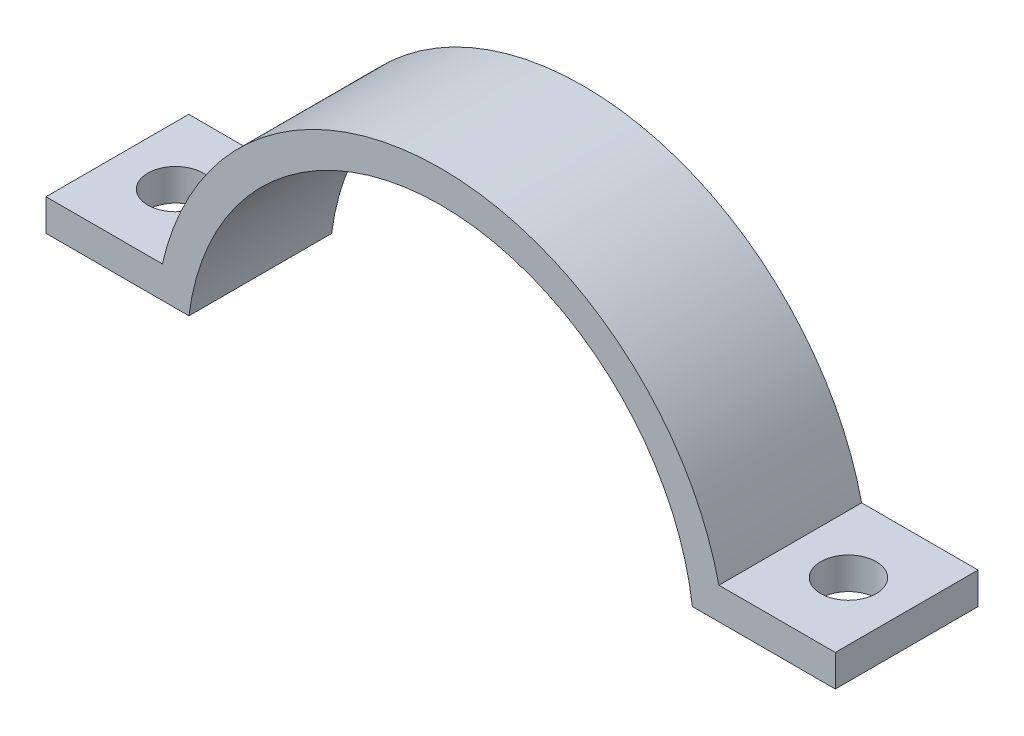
ISO-10303-21;
HEADER;
FILE_DESCRIPTION(('STEP AP214'),'2;1');
FILE_NAME('part.step','',(''),(''),'','','');
FILE_SCHEMA(('AUTOMOTIVE_DESIGN { 1 0 10303 214 1 1 1 1 }'));
ENDSEC;
DATA;
#1=APPLICATION_CONTEXT('core data for automotive mechanical design processes');
#2=APPLICATION_PROTOCOL_DEFINITION('international standard','automotive_design',2000,#1);
#3=PRODUCT_CONTEXT('',#1,'mechanical');
#4=PRODUCT('Part','Part','',(#3));
#5=PRODUCT_RELATED_PRODUCT_CATEGORY('part','',(#4));
#6=PRODUCT_DEFINITION_FORMATION('','',#4);
#7=PRODUCT_DEFINITION_CONTEXT('part definition',#1,'design');
#8=PRODUCT_DEFINITION('design','',#6,#7);
#9=PRODUCT_DEFINITION_SHAPE('','',#8);
#10=(LENGTH_UNIT() NAMED_UNIT(*) SI_UNIT(.MILLI.,.METRE.));
#11=(NAMED_UNIT(*) PLANE_ANGLE_UNIT() SI_UNIT($,.RADIAN.));
#12=(NAMED_UNIT(*) SI_UNIT($,.STERADIAN.) SOLID_ANGLE_UNIT());
#13=UNCERTAINTY_MEASURE_WITH_UNIT(LENGTH_MEASURE(1.E-05),#10,'distance_accuracy_value','');
#14=(GEOMETRIC_REPRESENTATION_CONTEXT(3) GLOBAL_UNCERTAINTY_ASSIGNED_CONTEXT((#13)) GLOBAL_UNIT_ASSIGNED_CONTEXT((#10,
#11,#12)) REPRESENTATION_CONTEXT('',''));
#15=CARTESIAN_POINT('',(0.,0.,0.));
#16=DIRECTION('',(0.,0.,1.));
#17=DIRECTION('',(1.,0.,0.));
#18=AXIS2_PLACEMENT_3D('',#15,#16,#17);
#19=CARTESIAN_POINT('',(0.,2.00000000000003,9.));
#20=DIRECTION('',(0.,1.,0.));
#21=DIRECTION('',(-1.,0.,0.));
#22=AXIS2_PLACEMENT_3D('',#19,#20,#21);
#23=PLANE('',#22);
#24=CARTESIAN_POINT('',(21.2192362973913,1.99999999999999,4.5));
#25=DIRECTION('',(0.,1.,0.));
#26=DIRECTION('',(-1.,0.,0.));
#27=AXIS2_PLACEMENT_3D('',#24,#25,#26);
#28=CIRCLE('',#27,1.75);
#29=CARTESIAN_POINT('',(19.4692362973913,1.99999999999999,4.5));
#30=VERTEX_POINT('',#29);
#31=EDGE_CURVE('E232',#30,#30,#28,.T.);
#32=ORIENTED_EDGE('',*,*,#31,.T.);
#33=EDGE_LOOP('',(#32));
#34=FACE_BOUND('',#33,.T.);
#35=DIRECTION('',(1.,0.,0.));
#36=VECTOR('',#35,1.);
#37=CARTESIAN_POINT('',(0.,2.00000000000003,0.));
#38=LINE('',#37,#36);
#39=CARTESIAN_POINT('',(15.8745078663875,2.,0.));
#40=VERTEX_POINT('',#39);
#41=CARTESIAN_POINT('',(24.8885438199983,2.,0.));
#42=VERTEX_POINT('',#41);
#43=EDGE_CURVE('E151',#40,#42,#38,.T.);
#44=ORIENTED_EDGE('',*,*,#43,.T.);
#45=DIRECTION('',(0.,0.,-1.));
#46=VECTOR('',#45,1.);
#47=CARTESIAN_POINT('',(24.8885438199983,2.,9.));
#48=LINE('',#47,#46);
#49=CARTESIAN_POINT('',(24.8885438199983,2.,9.));
#50=VERTEX_POINT('',#49);
#51=EDGE_CURVE('E11',#50,#42,#48,.T.);
#52=ORIENTED_EDGE('',*,*,#51,.F.);
#53=DIRECTION('',(1.,0.,0.));
#54=VECTOR('',#53,1.);
#55=CARTESIAN_POINT('',(0.,2.00000000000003,9.));
#56=LINE('',#55,#54);
#57=CARTESIAN_POINT('',(15.8745078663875,2.,9.));
#58=VERTEX_POINT('',#57);
#59=EDGE_CURVE('E179',#58,#50,#56,.T.);
#60=ORIENTED_EDGE('',*,*,#59,.F.);
#61=DIRECTION('',(0.,0.,-1.));
#62=VECTOR('',#61,1.);
#63=CARTESIAN_POINT('',(15.8745078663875,2.,9.));
#64=LINE('',#63,#62);
#65=EDGE_CURVE('E64',#58,#40,#64,.T.);
#66=ORIENTED_EDGE('',*,*,#65,.T.);
#67=EDGE_LOOP('',(#44,#52,#60,#66));
#68=FACE_BOUND('',#67,.T.);
#69=ADVANCED_FACE('F47',(#34,#68),#23,.F.);
#70=CARTESIAN_POINT('',(24.8885438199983,0.,9.));
#71=DIRECTION('',(-1.,0.,0.));
#72=DIRECTION('',(0.,0.,1.));
#73=AXIS2_PLACEMENT_3D('',#70,#71,#72);
#74=PLANE('',#73);
#75=DIRECTION('',(0.,1.,0.));
#76=VECTOR('',#75,1.);
#77=CARTESIAN_POINT('',(24.8885438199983,0.,0.));
#78=LINE('',#77,#76);
#79=CARTESIAN_POINT('',(24.8885438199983,3.99999999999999,0.));
#80=VERTEX_POINT('',#79);
#81=EDGE_CURVE('E154',#42,#80,#78,.T.);
#82=ORIENTED_EDGE('',*,*,#81,.T.);
#83=DIRECTION('',(0.,0.,-1.));
#84=VECTOR('',#83,1.);
#85=CARTESIAN_POINT('',(24.8885438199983,3.99999999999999,9.));
#86=LINE('',#85,#84);
#87=CARTESIAN_POINT('',(24.8885438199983,3.99999999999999,9.));
#88=VERTEX_POINT('',#87);
#89=EDGE_CURVE('E56',#88,#80,#86,.T.);
#90=ORIENTED_EDGE('',*,*,#89,.F.);
#91=DIRECTION('',(0.,1.,0.));
#92=VECTOR('',#91,1.);
#93=CARTESIAN_POINT('',(24.8885438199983,0.,9.));
#94=LINE('',#93,#92);
#95=EDGE_CURVE('E103',#50,#88,#94,.T.);
#96=ORIENTED_EDGE('',*,*,#95,.F.);
#97=ORIENTED_EDGE('',*,*,#51,.T.);
#98=EDGE_LOOP('',(#82,#90,#96,#97));
#99=FACE_BOUND('',#98,.T.);
#100=ADVANCED_FACE('F199',(#99),#74,.F.);
#101=CARTESIAN_POINT('',(0.,4.,9.));
#102=DIRECTION('',(0.,1.,0.));
#103=DIRECTION('',(-1.,0.,0.));
#104=AXIS2_PLACEMENT_3D('',#101,#102,#103);
#105=PLANE('',#104);
#106=CARTESIAN_POINT('',(21.2192362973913,4.,4.5));
#107=DIRECTION('',(0.,1.,0.));
#108=DIRECTION('',(-1.,0.,0.));
#109=AXIS2_PLACEMENT_3D('',#106,#107,#108);
#110=CIRCLE('',#109,1.75);
#111=CARTESIAN_POINT('',(19.4692362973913,4.,4.5));
#112=VERTEX_POINT('',#111);
#113=EDGE_CURVE('E243',#112,#112,#110,.T.);
#114=ORIENTED_EDGE('',*,*,#113,.F.);
#115=EDGE_LOOP('',(#114));
#116=FACE_BOUND('',#115,.T.);
#117=DIRECTION('',(1.,0.,0.));
#118=VECTOR('',#117,1.);
#119=CARTESIAN_POINT('',(0.,4.,0.));
#120=LINE('',#119,#118);
#121=CARTESIAN_POINT('',(17.5499287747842,3.99999999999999,0.));
#122=VERTEX_POINT('',#121);
#123=EDGE_CURVE('E159',#122,#80,#120,.T.);
#124=ORIENTED_EDGE('',*,*,#123,.F.);
#125=DIRECTION('',(0.,0.,-1.));
#126=VECTOR('',#125,1.);
#127=CARTESIAN_POINT('',(17.5499287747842,3.99999999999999,9.));
#128=LINE('',#127,#126);
#129=CARTESIAN_POINT('',(17.5499287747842,3.99999999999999,9.));
#130=VERTEX_POINT('',#129);
#131=EDGE_CURVE('E190',#130,#122,#128,.T.);
#132=ORIENTED_EDGE('',*,*,#131,.F.);
#133=DIRECTION('',(1.,0.,0.));
#134=VECTOR('',#133,1.);
#135=CARTESIAN_POINT('',(0.,4.,9.));
#136=LINE('',#135,#134);
#137=EDGE_CURVE('E198',#130,#88,#136,.T.);
#138=ORIENTED_EDGE('',*,*,#137,.T.);
#139=ORIENTED_EDGE('',*,*,#89,.T.);
#140=EDGE_LOOP('',(#124,#132,#138,#139));
#141=FACE_BOUND('',#140,.T.);
#142=ADVANCED_FACE('F196',(#116,#141),#105,.T.);
#143=CARTESIAN_POINT('',(0.,0.,9.));
#144=DIRECTION('',(0.,0.,-1.));
#145=DIRECTION('',(-1.,0.,0.));
#146=AXIS2_PLACEMENT_3D('',#143,#144,#145);
#147=CYLINDRICAL_SURFACE('',#146,18.);
#148=CARTESIAN_POINT('',(0.,0.,0.));
#149=DIRECTION('',(0.,0.,1.));
#150=DIRECTION('',(1.,0.,0.));
#151=AXIS2_PLACEMENT_3D('',#148,#149,#150);
#152=CIRCLE('',#151,18.);
#153=CARTESIAN_POINT('',(-17.5499287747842,4.,0.));
#154=VERTEX_POINT('',#153);
#155=EDGE_CURVE('E163',#122,#154,#152,.T.);
#156=ORIENTED_EDGE('',*,*,#155,.T.);
#157=DIRECTION('',(0.,0.,-1.));
#158=VECTOR('',#157,1.);
#159=CARTESIAN_POINT('',(-17.5499287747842,4.,9.));
#160=LINE('',#159,#158);
#161=CARTESIAN_POINT('',(-17.5499287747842,4.,9.));
#162=VERTEX_POINT('',#161);
#163=EDGE_CURVE('E186',#162,#154,#160,.T.);
#164=ORIENTED_EDGE('',*,*,#163,.F.);
#165=CARTESIAN_POINT('',(0.,0.,9.));
#166=DIRECTION('',(0.,0.,1.));
#167=DIRECTION('',(1.,0.,0.));
#168=AXIS2_PLACEMENT_3D('',#165,#166,#167);
#169=CIRCLE('',#168,18.);
#170=EDGE_CURVE('E145',#130,#162,#169,.T.);
#171=ORIENTED_EDGE('',*,*,#170,.F.);
#172=ORIENTED_EDGE('',*,*,#131,.T.);
#173=EDGE_LOOP('',(#156,#164,#171,#172));
#174=FACE_BOUND('',#173,.T.);
#175=ADVANCED_FACE('F207',(#174),#147,.T.);
#176=CARTESIAN_POINT('',(0.,4.,9.));
#177=DIRECTION('',(0.,-1.,0.));
#178=DIRECTION('',(1.,0.,0.));
#179=AXIS2_PLACEMENT_3D('',#176,#177,#178);
#180=PLANE('',#179);
#181=CARTESIAN_POINT('',(-21.2192362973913,4.,4.5));
#182=DIRECTION('',(0.,1.,0.));
#183=DIRECTION('',(-1.,0.,0.));
#184=AXIS2_PLACEMENT_3D('',#181,#182,#183);
#185=CIRCLE('',#184,1.75);
#186=CARTESIAN_POINT('',(-22.9692362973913,4.,4.5));
#187=VERTEX_POINT('',#186);
#188=EDGE_CURVE('E247',#187,#187,#185,.T.);
#189=ORIENTED_EDGE('',*,*,#188,.F.);
#190=EDGE_LOOP('',(#189));
#191=FACE_BOUND('',#190,.T.);
#192=DIRECTION('',(-1.,0.,0.));
#193=VECTOR('',#192,1.);
#194=CARTESIAN_POINT('',(0.,4.,0.));
#195=LINE('',#194,#193);
#196=CARTESIAN_POINT('',(-24.8885438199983,3.99999999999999,0.));
#197=VERTEX_POINT('',#196);
#198=EDGE_CURVE('E166',#154,#197,#195,.T.);
#199=ORIENTED_EDGE('',*,*,#198,.T.);
#200=DIRECTION('',(0.,0.,-1.));
#201=VECTOR('',#200,1.);
#202=CARTESIAN_POINT('',(-24.8885438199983,3.99999999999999,9.));
#203=LINE('',#202,#201);
#204=CARTESIAN_POINT('',(-24.8885438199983,3.99999999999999,9.));
#205=VERTEX_POINT('',#204);
#206=EDGE_CURVE('E129',#205,#197,#203,.T.);
#207=ORIENTED_EDGE('',*,*,#206,.F.);
#208=DIRECTION('',(-1.,0.,0.));
#209=VECTOR('',#208,1.);
#210=CARTESIAN_POINT('',(0.,4.,9.));
#211=LINE('',#210,#209);
#212=EDGE_CURVE('E140',#162,#205,#211,.T.);
#213=ORIENTED_EDGE('',*,*,#212,.F.);
#214=ORIENTED_EDGE('',*,*,#163,.T.);
#215=EDGE_LOOP('',(#199,#207,#213,#214));
#216=FACE_BOUND('',#215,.T.);
#217=ADVANCED_FACE('F210',(#191,#216),#180,.F.);
#218=CARTESIAN_POINT('',(-24.8885438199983,0.,9.));
#219=DIRECTION('',(-1.,0.,0.));
#220=DIRECTION('',(0.,0.,1.));
#221=AXIS2_PLACEMENT_3D('',#218,#219,#220);
#222=PLANE('',#221);
#223=DIRECTION('',(0.,1.,0.));
#224=VECTOR('',#223,1.);
#225=CARTESIAN_POINT('',(-24.8885438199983,0.,0.));
#226=LINE('',#225,#224);
#227=CARTESIAN_POINT('',(-24.8885438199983,1.99999999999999,0.));
#228=VERTEX_POINT('',#227);
#229=EDGE_CURVE('E125',#228,#197,#226,.T.);
#230=ORIENTED_EDGE('',*,*,#229,.F.);
#231=DIRECTION('',(0.,0.,-1.));
#232=VECTOR('',#231,1.);
#233=CARTESIAN_POINT('',(-24.8885438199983,1.99999999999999,9.));
#234=LINE('',#233,#232);
#235=CARTESIAN_POINT('',(-24.8885438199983,1.99999999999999,9.));
#236=VERTEX_POINT('',#235);
#237=EDGE_CURVE('E119',#236,#228,#234,.T.);
#238=ORIENTED_EDGE('',*,*,#237,.F.);
#239=DIRECTION('',(0.,1.,0.));
#240=VECTOR('',#239,1.);
#241=CARTESIAN_POINT('',(-24.8885438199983,0.,9.));
#242=LINE('',#241,#240);
#243=EDGE_CURVE('E123',#236,#205,#242,.T.);
#244=ORIENTED_EDGE('',*,*,#243,.T.);
#245=ORIENTED_EDGE('',*,*,#206,.T.);
#246=EDGE_LOOP('',(#230,#238,#244,#245));
#247=FACE_BOUND('',#246,.T.);
#248=ADVANCED_FACE('F121',(#247),#222,.T.);
#249=CARTESIAN_POINT('',(0.,2.00000000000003,9.));
#250=DIRECTION('',(0.,1.,0.));
#251=DIRECTION('',(-1.,0.,0.));
#252=AXIS2_PLACEMENT_3D('',#249,#250,#251);
#253=PLANE('',#252);
#254=CARTESIAN_POINT('',(-21.2192362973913,1.99999999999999,4.5));
#255=DIRECTION('',(0.,1.,0.));
#256=DIRECTION('',(-1.,0.,0.));
#257=AXIS2_PLACEMENT_3D('',#254,#255,#256);
#258=CIRCLE('',#257,1.75);
#259=CARTESIAN_POINT('',(-22.9692362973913,1.99999999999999,4.5));
#260=VERTEX_POINT('',#259);
#261=EDGE_CURVE('E155',#260,#260,#258,.T.);
#262=ORIENTED_EDGE('',*,*,#261,.T.);
#263=EDGE_LOOP('',(#262));
#264=FACE_BOUND('',#263,.T.);
#265=DIRECTION('',(1.,0.,0.));
#266=VECTOR('',#265,1.);
#267=CARTESIAN_POINT('',(0.,2.00000000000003,0.));
#268=LINE('',#267,#266);
#269=CARTESIAN_POINT('',(-15.8745078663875,2.,0.));
#270=VERTEX_POINT('',#269);
#271=EDGE_CURVE('E172',#228,#270,#268,.T.);
#272=ORIENTED_EDGE('',*,*,#271,.T.);
#273=DIRECTION('',(0.,0.,-1.));
#274=VECTOR('',#273,1.);
#275=CARTESIAN_POINT('',(-15.8745078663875,2.,9.));
#276=LINE('',#275,#274);
#277=CARTESIAN_POINT('',(-15.8745078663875,2.,9.));
#278=VERTEX_POINT('',#277);
#279=EDGE_CURVE('E91',#278,#270,#276,.T.);
#280=ORIENTED_EDGE('',*,*,#279,.F.);
#281=DIRECTION('',(1.,0.,0.));
#282=VECTOR('',#281,1.);
#283=CARTESIAN_POINT('',(0.,2.00000000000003,9.));
#284=LINE('',#283,#282);
#285=EDGE_CURVE('E131',#236,#278,#284,.T.);
#286=ORIENTED_EDGE('',*,*,#285,.F.);
#287=ORIENTED_EDGE('',*,*,#237,.T.);
#288=EDGE_LOOP('',(#272,#280,#286,#287));
#289=FACE_BOUND('',#288,.T.);
#290=ADVANCED_FACE('F132',(#264,#289),#253,.F.);
#291=CARTESIAN_POINT('',(0.,0.,9.));
#292=DIRECTION('',(0.,0.,-1.));
#293=DIRECTION('',(-1.,0.,0.));
#294=AXIS2_PLACEMENT_3D('',#291,#292,#293);
#295=CYLINDRICAL_SURFACE('',#294,16.);
#296=CARTESIAN_POINT('',(0.,0.,0.));
#297=DIRECTION('',(0.,0.,1.));
#298=DIRECTION('',(1.,0.,0.));
#299=AXIS2_PLACEMENT_3D('',#296,#297,#298);
#300=CIRCLE('',#299,16.);
#301=EDGE_CURVE('E175',#40,#270,#300,.T.);
#302=ORIENTED_EDGE('',*,*,#301,.F.);
#303=ORIENTED_EDGE('',*,*,#65,.F.);
#304=CARTESIAN_POINT('',(0.,0.,9.));
#305=DIRECTION('',(0.,0.,1.));
#306=DIRECTION('',(1.,0.,0.));
#307=AXIS2_PLACEMENT_3D('',#304,#305,#306);
#308=CIRCLE('',#307,16.);
#309=EDGE_CURVE('E136',#58,#278,#308,.T.);
#310=ORIENTED_EDGE('',*,*,#309,.T.);
#311=ORIENTED_EDGE('',*,*,#279,.T.);
#312=EDGE_LOOP('',(#302,#303,#310,#311));
#313=FACE_BOUND('',#312,.T.);
#314=ADVANCED_FACE('F211',(#313),#295,.F.);
#315=CARTESIAN_POINT('',(0.,0.,9.));
#316=DIRECTION('',(0.,0.,1.));
#317=DIRECTION('',(1.,0.,0.));
#318=AXIS2_PLACEMENT_3D('',#315,#316,#317);
#319=PLANE('',#318);
#320=ORIENTED_EDGE('',*,*,#59,.T.);
#321=ORIENTED_EDGE('',*,*,#95,.T.);
#322=ORIENTED_EDGE('',*,*,#137,.F.);
#323=ORIENTED_EDGE('',*,*,#170,.T.);
#324=ORIENTED_EDGE('',*,*,#212,.T.);
#325=ORIENTED_EDGE('',*,*,#243,.F.);
#326=ORIENTED_EDGE('',*,*,#285,.T.);
#327=ORIENTED_EDGE('',*,*,#309,.F.);
#328=EDGE_LOOP('',(#320,#321,#322,#323,#324,#325,#326,#327));
#329=FACE_BOUND('',#328,.T.);
#330=ADVANCED_FACE('F138',(#329),#319,.T.);
#331=CARTESIAN_POINT('',(0.,0.,0.));
#332=DIRECTION('',(0.,0.,1.));
#333=DIRECTION('',(1.,0.,0.));
#334=AXIS2_PLACEMENT_3D('',#331,#332,#333);
#335=PLANE('',#334);
#336=ORIENTED_EDGE('',*,*,#43,.F.);
#337=ORIENTED_EDGE('',*,*,#301,.T.);
#338=ORIENTED_EDGE('',*,*,#271,.F.);
#339=ORIENTED_EDGE('',*,*,#229,.T.);
#340=ORIENTED_EDGE('',*,*,#198,.F.);
#341=ORIENTED_EDGE('',*,*,#155,.F.);
#342=ORIENTED_EDGE('',*,*,#123,.T.);
#343=ORIENTED_EDGE('',*,*,#81,.F.);
#344=EDGE_LOOP('',(#336,#337,#338,#339,#340,#341,#342,#343));
#345=FACE_BOUND('',#344,.T.);
#346=ADVANCED_FACE('F203',(#345),#335,.F.);
#347=CARTESIAN_POINT('',(-21.2192362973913,1.99999999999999,4.5));
#348=DIRECTION('',(0.,1.,0.));
#349=DIRECTION('',(-1.,0.,0.));
#350=AXIS2_PLACEMENT_3D('',#347,#348,#349);
#351=CYLINDRICAL_SURFACE('',#350,1.75);
#352=ORIENTED_EDGE('',*,*,#261,.F.);
#353=EDGE_LOOP('',(#352));
#354=FACE_BOUND('',#353,.T.);
#355=ORIENTED_EDGE('',*,*,#188,.T.);
#356=EDGE_LOOP('',(#355));
#357=FACE_BOUND('',#356,.T.);
#358=ADVANCED_FACE('F255',(#354,#357),#351,.F.);
#359=CARTESIAN_POINT('',(21.2192362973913,1.99999999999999,4.5));
#360=DIRECTION('',(0.,1.,0.));
#361=DIRECTION('',(-1.,0.,0.));
#362=AXIS2_PLACEMENT_3D('',#359,#360,#361);
#363=CYLINDRICAL_SURFACE('',#362,1.75);
#364=ORIENTED_EDGE('',*,*,#31,.F.);
#365=EDGE_LOOP('',(#364));
#366=FACE_BOUND('',#365,.T.);
#367=ORIENTED_EDGE('',*,*,#113,.T.);
#368=EDGE_LOOP('',(#367));
#369=FACE_BOUND('',#368,.T.);
#370=ADVANCED_FACE('F258',(#366,#369),#363,.F.);
#371=CLOSED_SHELL('',(#69,#100,#142,#175,#217,#248,#290,#314,#330,#346,#358,#370));
#372=MANIFOLD_SOLID_BREP('B2',#371);
#373=ADVANCED_BREP_SHAPE_REPRESENTATION('',(#18,#372),#14);
#374=SHAPE_DEFINITION_REPRESENTATION(#9,#373);
ENDSEC;
END-ISO-10303-21;
